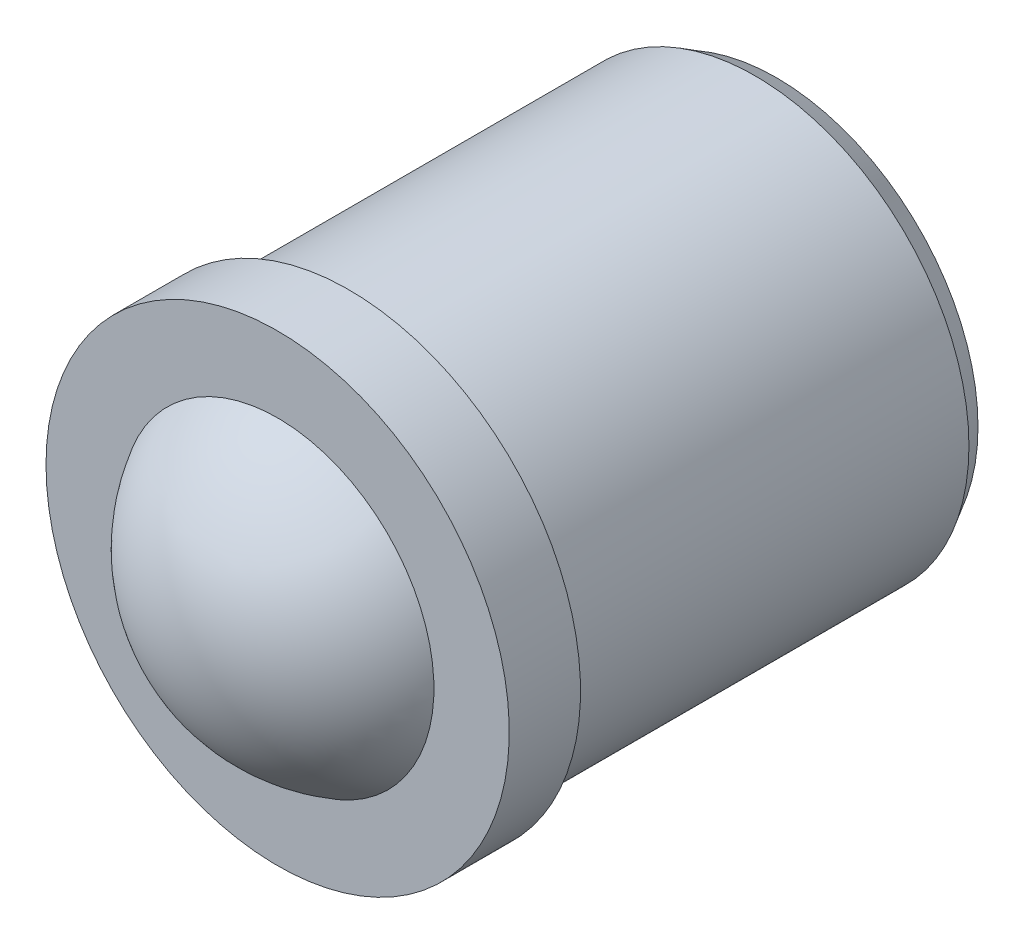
ISO-10303-21;
HEADER;
FILE_DESCRIPTION(('STEP AP214'),'2;1');
FILE_NAME('part.step','',(''),(''),'','','');
FILE_SCHEMA(('AUTOMOTIVE_DESIGN { 1 0 10303 214 1 1 1 1 }'));
ENDSEC;
DATA;
#1=APPLICATION_CONTEXT('core data for automotive mechanical design processes');
#2=APPLICATION_PROTOCOL_DEFINITION('international standard','automotive_design',2000,#1);
#3=PRODUCT_CONTEXT('',#1,'mechanical');
#4=PRODUCT('Part','Part','',(#3));
#5=PRODUCT_RELATED_PRODUCT_CATEGORY('part','',(#4));
#6=PRODUCT_DEFINITION_FORMATION('','',#4);
#7=PRODUCT_DEFINITION_CONTEXT('part definition',#1,'design');
#8=PRODUCT_DEFINITION('design','',#6,#7);
#9=PRODUCT_DEFINITION_SHAPE('','',#8);
#10=(LENGTH_UNIT() NAMED_UNIT(*) SI_UNIT(.MILLI.,.METRE.));
#11=(NAMED_UNIT(*) PLANE_ANGLE_UNIT() SI_UNIT($,.RADIAN.));
#12=(NAMED_UNIT(*) SI_UNIT($,.STERADIAN.) SOLID_ANGLE_UNIT());
#13=UNCERTAINTY_MEASURE_WITH_UNIT(LENGTH_MEASURE(1.E-05),#10,'distance_accuracy_value','');
#14=(GEOMETRIC_REPRESENTATION_CONTEXT(3) GLOBAL_UNCERTAINTY_ASSIGNED_CONTEXT((#13)) GLOBAL_UNIT_ASSIGNED_CONTEXT((#10,
#11,#12)) REPRESENTATION_CONTEXT('',''));
#15=CARTESIAN_POINT('',(0.,0.,0.));
#16=DIRECTION('',(0.,0.,1.));
#17=DIRECTION('',(1.,0.,0.));
#18=AXIS2_PLACEMENT_3D('',#15,#16,#17);
#19=CARTESIAN_POINT('',(0.,0.,-6.));
#20=DIRECTION('',(0.,0.,1.));
#21=DIRECTION('',(-1.,0.,0.));
#22=AXIS2_PLACEMENT_3D('',#19,#20,#21);
#23=PLANE('',#22);
#24=CARTESIAN_POINT('',(0.,0.,-6.));
#25=DIRECTION('',(0.,0.,1.));
#26=DIRECTION('',(-1.,0.,0.));
#27=AXIS2_PLACEMENT_3D('',#24,#25,#26);
#28=CIRCLE('',#27,2.82679491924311);
#29=CARTESIAN_POINT('',(-2.82679491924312,0.,-6.));
#30=VERTEX_POINT('',#29);
#31=EDGE_CURVE('E18',#30,#30,#28,.T.);
#32=ORIENTED_EDGE('',*,*,#31,.F.);
#33=EDGE_LOOP('',(#32));
#34=FACE_BOUND('',#33,.T.);
#35=ADVANCED_FACE('F12',(#34),#23,.F.);
#36=CARTESIAN_POINT('',(0.,0.,-6.));
#37=DIRECTION('',(0.,0.,1.));
#38=DIRECTION('',(-1.,0.,0.));
#39=AXIS2_PLACEMENT_3D('',#36,#37,#38);
#40=CONICAL_SURFACE('',#39,2.82679491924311,0.523598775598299);
#41=CARTESIAN_POINT('',(0.,0.,-5.7));
#42=DIRECTION('',(0.,0.,1.));
#43=DIRECTION('',(-1.,0.,0.));
#44=AXIS2_PLACEMENT_3D('',#41,#42,#43);
#45=CIRCLE('',#44,3.);
#46=CARTESIAN_POINT('',(-3.,0.,-5.7));
#47=VERTEX_POINT('',#46);
#48=EDGE_CURVE('E22',#47,#47,#45,.T.);
#49=ORIENTED_EDGE('',*,*,#48,.F.);
#50=EDGE_LOOP('',(#49));
#51=FACE_BOUND('',#50,.T.);
#52=ORIENTED_EDGE('',*,*,#31,.T.);
#53=EDGE_LOOP('',(#52));
#54=FACE_BOUND('',#53,.T.);
#55=ADVANCED_FACE('F55',(#51,#54),#40,.T.);
#56=CARTESIAN_POINT('',(0.,0.,1.));
#57=DIRECTION('',(0.,0.,1.));
#58=DIRECTION('',(-1.,0.,0.));
#59=AXIS2_PLACEMENT_3D('',#56,#57,#58);
#60=CYLINDRICAL_SURFACE('',#59,3.);
#61=CARTESIAN_POINT('',(0.,0.,0.));
#62=DIRECTION('',(0.,0.,1.));
#63=DIRECTION('',(-1.,0.,0.));
#64=AXIS2_PLACEMENT_3D('',#61,#62,#63);
#65=CIRCLE('',#64,3.);
#66=CARTESIAN_POINT('',(-3.,0.,0.));
#67=VERTEX_POINT('',#66);
#68=EDGE_CURVE('E26',#67,#67,#65,.T.);
#69=ORIENTED_EDGE('',*,*,#68,.F.);
#70=EDGE_LOOP('',(#69));
#71=FACE_BOUND('',#70,.T.);
#72=ORIENTED_EDGE('',*,*,#48,.T.);
#73=EDGE_LOOP('',(#72));
#74=FACE_BOUND('',#73,.T.);
#75=ADVANCED_FACE('F49',(#71,#74),#60,.T.);
#76=CARTESIAN_POINT('',(-3.,0.,0.));
#77=DIRECTION('',(0.,0.,1.));
#78=DIRECTION('',(-1.,0.,0.));
#79=AXIS2_PLACEMENT_3D('',#76,#77,#78);
#80=PLANE('',#79);
#81=CARTESIAN_POINT('',(0.,0.,0.));
#82=DIRECTION('',(0.,0.,1.));
#83=DIRECTION('',(-1.,0.,0.));
#84=AXIS2_PLACEMENT_3D('',#81,#82,#83);
#85=CIRCLE('',#84,3.25);
#86=CARTESIAN_POINT('',(-3.25,0.,0.));
#87=VERTEX_POINT('',#86);
#88=EDGE_CURVE('E31',#87,#87,#85,.T.);
#89=ORIENTED_EDGE('',*,*,#88,.F.);
#90=EDGE_LOOP('',(#89));
#91=FACE_BOUND('',#90,.T.);
#92=ORIENTED_EDGE('',*,*,#68,.T.);
#93=EDGE_LOOP('',(#92));
#94=FACE_BOUND('',#93,.T.);
#95=ADVANCED_FACE('F43',(#91,#94),#80,.F.);
#96=CARTESIAN_POINT('',(0.,0.,1.));
#97=DIRECTION('',(0.,0.,1.));
#98=DIRECTION('',(-1.,0.,0.));
#99=AXIS2_PLACEMENT_3D('',#96,#97,#98);
#100=CYLINDRICAL_SURFACE('',#99,3.25);
#101=CARTESIAN_POINT('',(0.,0.,1.));
#102=DIRECTION('',(0.,0.,1.));
#103=DIRECTION('',(-1.,0.,0.));
#104=AXIS2_PLACEMENT_3D('',#101,#102,#103);
#105=CIRCLE('',#104,3.25);
#106=CARTESIAN_POINT('',(-3.25,0.,1.));
#107=VERTEX_POINT('',#106);
#108=EDGE_CURVE('E34',#107,#107,#105,.T.);
#109=ORIENTED_EDGE('',*,*,#108,.F.);
#110=EDGE_LOOP('',(#109));
#111=FACE_BOUND('',#110,.T.);
#112=ORIENTED_EDGE('',*,*,#88,.T.);
#113=EDGE_LOOP('',(#112));
#114=FACE_BOUND('',#113,.T.);
#115=ADVANCED_FACE('F40',(#111,#114),#100,.T.);
#116=CARTESIAN_POINT('',(-3.25,0.,1.));
#117=DIRECTION('',(0.,0.,-1.));
#118=DIRECTION('',(1.,0.,0.));
#119=AXIS2_PLACEMENT_3D('',#116,#117,#118);
#120=PLANE('',#119);
#121=ORIENTED_EDGE('',*,*,#108,.T.);
#122=EDGE_LOOP('',(#121));
#123=FACE_BOUND('',#122,.T.);
#124=CARTESIAN_POINT('',(0.,0.,1.));
#125=DIRECTION('',(0.,0.,1.));
#126=DIRECTION('',(-1.,0.,0.));
#127=AXIS2_PLACEMENT_3D('',#124,#125,#126);
#128=CIRCLE('',#127,2.19317121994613);
#129=CARTESIAN_POINT('',(-2.19317121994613,0.,1.));
#130=VERTEX_POINT('',#129);
#131=EDGE_CURVE('E8',#130,#130,#128,.F.);
#132=ORIENTED_EDGE('',*,*,#131,.T.);
#133=EDGE_LOOP('',(#132));
#134=FACE_BOUND('',#133,.T.);
#135=ADVANCED_FACE('F38',(#123,#134),#120,.F.);
#136=CARTESIAN_POINT('',(0.,0.,-0.2));
#137=DIRECTION('',(0.,0.,-1.));
#138=DIRECTION('',(-1.,0.,0.));
#139=AXIS2_PLACEMENT_3D('',#136,#137,#138);
#140=SPHERICAL_SURFACE('',#139,2.5);
#141=ORIENTED_EDGE('',*,*,#131,.F.);
#142=EDGE_LOOP('',(#141));
#143=FACE_BOUND('',#142,.T.);
#144=ADVANCED_FACE('F68',(#143),#140,.T.);
#145=CLOSED_SHELL('',(#35,#55,#75,#95,#115,#135,#144));
#146=MANIFOLD_SOLID_BREP('B1',#145);
#147=ADVANCED_BREP_SHAPE_REPRESENTATION('',(#18,#146),#14);
#148=SHAPE_DEFINITION_REPRESENTATION(#9,#147);
ENDSEC;
END-ISO-10303-21;
